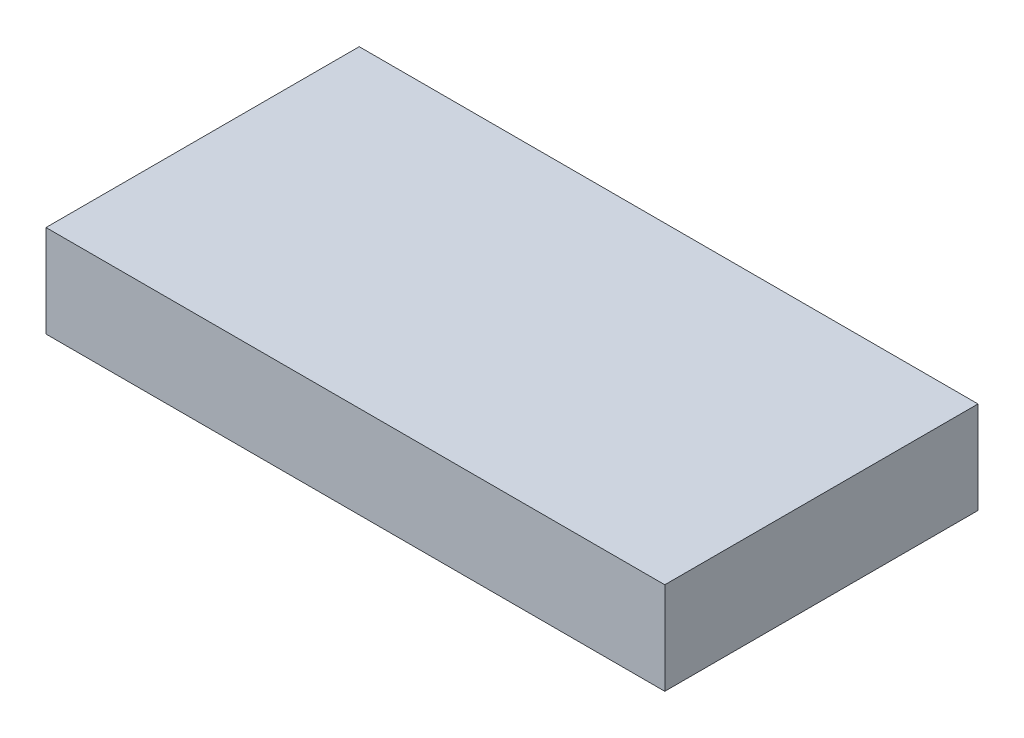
ISO-10303-21;
HEADER;
FILE_DESCRIPTION(('STEP AP214'),'2;1');
FILE_NAME('part.step','',(''),(''),'','','');
FILE_SCHEMA(('AUTOMOTIVE_DESIGN { 1 0 10303 214 1 1 1 1 }'));
ENDSEC;
DATA;
#1=APPLICATION_CONTEXT('core data for automotive mechanical design processes');
#2=APPLICATION_PROTOCOL_DEFINITION('international standard','automotive_design',2000,#1);
#3=PRODUCT_CONTEXT('',#1,'mechanical');
#4=PRODUCT('Part','Part','',(#3));
#5=PRODUCT_RELATED_PRODUCT_CATEGORY('part','',(#4));
#6=PRODUCT_DEFINITION_FORMATION('','',#4);
#7=PRODUCT_DEFINITION_CONTEXT('part definition',#1,'design');
#8=PRODUCT_DEFINITION('design','',#6,#7);
#9=PRODUCT_DEFINITION_SHAPE('','',#8);
#10=(LENGTH_UNIT() NAMED_UNIT(*) SI_UNIT(.MILLI.,.METRE.));
#11=(NAMED_UNIT(*) PLANE_ANGLE_UNIT() SI_UNIT($,.RADIAN.));
#12=(NAMED_UNIT(*) SI_UNIT($,.STERADIAN.) SOLID_ANGLE_UNIT());
#13=UNCERTAINTY_MEASURE_WITH_UNIT(LENGTH_MEASURE(1.E-05),#10,'distance_accuracy_value','');
#14=(GEOMETRIC_REPRESENTATION_CONTEXT(3) GLOBAL_UNCERTAINTY_ASSIGNED_CONTEXT((#13)) GLOBAL_UNIT_ASSIGNED_CONTEXT((#10,
#11,#12)) REPRESENTATION_CONTEXT('',''));
#15=CARTESIAN_POINT('',(0.,0.,0.));
#16=DIRECTION('',(0.,0.,1.));
#17=DIRECTION('',(1.,0.,0.));
#18=AXIS2_PLACEMENT_3D('',#15,#16,#17);
#19=CARTESIAN_POINT('',(0.,0.,0.));
#20=DIRECTION('',(0.,1.,0.));
#21=DIRECTION('',(-1.,0.,0.));
#22=AXIS2_PLACEMENT_3D('',#19,#20,#21);
#23=PLANE('',#22);
#24=CARTESIAN_POINT('',(23.5,-1.64099622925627E-13,-54.016));
#25=DIRECTION('',(0.,1.,0.));
#26=DIRECTION('',(-1.,0.,0.));
#27=AXIS2_PLACEMENT_3D('',#24,#25,#26);
#28=CIRCLE('',#27,2.5);
#29=CARTESIAN_POINT('',(21.,-1.46642216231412E-13,-54.016));
#30=VERTEX_POINT('',#29);
#31=EDGE_CURVE('E403',#30,#30,#28,.T.);
#32=ORIENTED_EDGE('',*,*,#31,.T.);
#33=EDGE_LOOP('',(#32));
#34=FACE_BOUND('',#33,.T.);
#35=CARTESIAN_POINT('',(-23.5,1.64099622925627E-13,-54.016));
#36=DIRECTION('',(0.,1.,0.));
#37=DIRECTION('',(-1.,0.,0.));
#38=AXIS2_PLACEMENT_3D('',#35,#36,#37);
#39=CIRCLE('',#38,2.5);
#40=CARTESIAN_POINT('',(-26.,1.81557029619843E-13,-54.016));
#41=VERTEX_POINT('',#40);
#42=EDGE_CURVE('E11',#41,#41,#39,.F.);
#43=ORIENTED_EDGE('',*,*,#42,.F.);
#44=EDGE_LOOP('',(#43));
#45=FACE_BOUND('',#44,.T.);
#46=CARTESIAN_POINT('',(23.5,-1.64099622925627E-13,-5.166));
#47=DIRECTION('',(0.,1.,0.));
#48=DIRECTION('',(-1.,0.,0.));
#49=AXIS2_PLACEMENT_3D('',#46,#47,#48);
#50=CIRCLE('',#49,2.5);
#51=CARTESIAN_POINT('',(21.,-1.46642216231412E-13,-5.166));
#52=VERTEX_POINT('',#51);
#53=EDGE_CURVE('E257',#52,#52,#50,.T.);
#54=ORIENTED_EDGE('',*,*,#53,.T.);
#55=EDGE_LOOP('',(#54));
#56=FACE_BOUND('',#55,.T.);
#57=CARTESIAN_POINT('',(-23.5,1.64099622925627E-13,-5.166));
#58=DIRECTION('',(0.,1.,0.));
#59=DIRECTION('',(-1.,0.,0.));
#60=AXIS2_PLACEMENT_3D('',#57,#58,#59);
#61=CIRCLE('',#60,2.5);
#62=CARTESIAN_POINT('',(-26.,1.81557029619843E-13,-5.166));
#63=VERTEX_POINT('',#62);
#64=EDGE_CURVE('E42',#63,#63,#61,.F.);
#65=ORIENTED_EDGE('',*,*,#64,.F.);
#66=EDGE_LOOP('',(#65));
#67=FACE_BOUND('',#66,.T.);
#68=DIRECTION('',(0.,0.,-1.));
#69=VECTOR('',#68,1.);
#70=CARTESIAN_POINT('',(2.76195092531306,0.,4.84));
#71=LINE('',#70,#69);
#72=CARTESIAN_POINT('',(2.76195092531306,0.,0.));
#73=VERTEX_POINT('',#72);
#74=CARTESIAN_POINT('',(2.76195092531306,0.,2.334));
#75=VERTEX_POINT('',#74);
#76=EDGE_CURVE('E50',#73,#75,#71,.F.);
#77=ORIENTED_EDGE('',*,*,#76,.F.);
#78=DIRECTION('',(-1.,0.,0.));
#79=VECTOR('',#78,1.);
#80=CARTESIAN_POINT('',(-5.00000000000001,0.,0.));
#81=LINE('',#80,#79);
#82=CARTESIAN_POINT('',(5.00000000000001,0.,0.));
#83=VERTEX_POINT('',#82);
#84=EDGE_CURVE('E355',#83,#73,#81,.T.);
#85=ORIENTED_EDGE('',*,*,#84,.F.);
#86=DIRECTION('',(0.,0.,-1.));
#87=VECTOR('',#86,1.);
#88=CARTESIAN_POINT('',(5.00000000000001,0.,-15.));
#89=LINE('',#88,#87);
#90=CARTESIAN_POINT('',(5.00000000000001,0.,-15.));
#91=VERTEX_POINT('',#90);
#92=EDGE_CURVE('E333',#83,#91,#89,.T.);
#93=ORIENTED_EDGE('',*,*,#92,.T.);
#94=DIRECTION('',(1.,0.,0.));
#95=VECTOR('',#94,1.);
#96=CARTESIAN_POINT('',(10.,0.,-15.));
#97=LINE('',#96,#95);
#98=CARTESIAN_POINT('',(10.,0.,-15.));
#99=VERTEX_POINT('',#98);
#100=EDGE_CURVE('E336',#91,#99,#97,.T.);
#101=ORIENTED_EDGE('',*,*,#100,.T.);
#102=CARTESIAN_POINT('',(5.62175338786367,0.,-17.4147373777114));
#103=DIRECTION('',(0.,1.,0.));
#104=DIRECTION('',(0.,0.,1.));
#105=AXIS2_PLACEMENT_3D('',#102,#103,#104);
#106=CIRCLE('',#105,5.);
#107=CARTESIAN_POINT('',(10.6036052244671,0.,-17.8403572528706));
#108=VERTEX_POINT('',#107);
#109=EDGE_CURVE('E339',#99,#108,#106,.T.);
#110=ORIENTED_EDGE('',*,*,#109,.T.);
#111=CARTESIAN_POINT('',(44.5633042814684,0.,-27.0225804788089));
#112=DIRECTION('',(0.,-1.,0.));
#113=DIRECTION('',(0.,0.,1.));
#114=AXIS2_PLACEMENT_3D('',#111,#112,#113);
#115=CIRCLE('',#114,35.1791754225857);
#116=CARTESIAN_POINT('',(10.6036052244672,0.,-36.2048037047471));
#117=VERTEX_POINT('',#116);
#118=EDGE_CURVE('E342',#108,#117,#115,.T.);
#119=ORIENTED_EDGE('',*,*,#118,.T.);
#120=CARTESIAN_POINT('',(7.31035400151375,0.,-39.9670498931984));
#121=DIRECTION('',(0.,1.,0.));
#122=DIRECTION('',(0.,0.,-1.));
#123=AXIS2_PLACEMENT_3D('',#120,#121,#122);
#124=CIRCLE('',#123,5.);
#125=CARTESIAN_POINT('',(10.,0.,-44.182));
#126=VERTEX_POINT('',#125);
#127=EDGE_CURVE('E345',#117,#126,#124,.T.);
#128=ORIENTED_EDGE('',*,*,#127,.T.);
#129=DIRECTION('',(-1.,0.,0.));
#130=VECTOR('',#129,1.);
#131=CARTESIAN_POINT('',(5.,0.,-44.182));
#132=LINE('',#131,#130);
#133=CARTESIAN_POINT('',(5.,0.,-44.182));
#134=VERTEX_POINT('',#133);
#135=EDGE_CURVE('E348',#126,#134,#132,.T.);
#136=ORIENTED_EDGE('',*,*,#135,.T.);
#137=DIRECTION('',(0.,0.,-1.));
#138=VECTOR('',#137,1.);
#139=CARTESIAN_POINT('',(5.,0.,-59.182));
#140=LINE('',#139,#138);
#141=CARTESIAN_POINT('',(5.,0.,-59.182));
#142=VERTEX_POINT('',#141);
#143=EDGE_CURVE('E351',#134,#142,#140,.T.);
#144=ORIENTED_EDGE('',*,*,#143,.T.);
#145=DIRECTION('',(1.,0.,0.));
#146=VECTOR('',#145,1.);
#147=CARTESIAN_POINT('',(0.,0.,-59.182));
#148=LINE('',#147,#146);
#149=CARTESIAN_POINT('',(-5.,0.,-59.182));
#150=VERTEX_POINT('',#149);
#151=EDGE_CURVE('E378',#150,#142,#148,.T.);
#152=ORIENTED_EDGE('',*,*,#151,.F.);
#153=DIRECTION('',(0.,0.,-1.));
#154=VECTOR('',#153,1.);
#155=CARTESIAN_POINT('',(-5.,0.,-59.182));
#156=LINE('',#155,#154);
#157=CARTESIAN_POINT('',(-5.,0.,-44.182));
#158=VERTEX_POINT('',#157);
#159=EDGE_CURVE('E375',#158,#150,#156,.T.);
#160=ORIENTED_EDGE('',*,*,#159,.F.);
#161=DIRECTION('',(1.,0.,0.));
#162=VECTOR('',#161,1.);
#163=CARTESIAN_POINT('',(-5.,0.,-44.182));
#164=LINE('',#163,#162);
#165=CARTESIAN_POINT('',(-10.,0.,-44.182));
#166=VERTEX_POINT('',#165);
#167=EDGE_CURVE('E372',#166,#158,#164,.T.);
#168=ORIENTED_EDGE('',*,*,#167,.F.);
#169=CARTESIAN_POINT('',(-7.31035400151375,0.,-39.9670498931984));
#170=DIRECTION('',(0.,-1.,0.));
#171=DIRECTION('',(0.,0.,-1.));
#172=AXIS2_PLACEMENT_3D('',#169,#170,#171);
#173=CIRCLE('',#172,5.);
#174=CARTESIAN_POINT('',(-10.6036052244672,0.,-36.2048037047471));
#175=VERTEX_POINT('',#174);
#176=EDGE_CURVE('E369',#175,#166,#173,.T.);
#177=ORIENTED_EDGE('',*,*,#176,.F.);
#178=CARTESIAN_POINT('',(-44.5633042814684,3.11183890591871E-13,-27.0225804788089));
#179=DIRECTION('',(0.,1.,0.));
#180=DIRECTION('',(0.,0.,1.));
#181=AXIS2_PLACEMENT_3D('',#178,#179,#180);
#182=CIRCLE('',#181,35.1791754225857);
#183=CARTESIAN_POINT('',(-10.6036052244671,0.,-17.8403572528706));
#184=VERTEX_POINT('',#183);
#185=EDGE_CURVE('E366',#184,#175,#182,.T.);
#186=ORIENTED_EDGE('',*,*,#185,.F.);
#187=CARTESIAN_POINT('',(-5.62175338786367,0.,-17.4147373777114));
#188=DIRECTION('',(0.,-1.,0.));
#189=DIRECTION('',(0.,0.,1.));
#190=AXIS2_PLACEMENT_3D('',#187,#188,#189);
#191=CIRCLE('',#190,5.);
#192=CARTESIAN_POINT('',(-10.,0.,-15.));
#193=VERTEX_POINT('',#192);
#194=EDGE_CURVE('E363',#193,#184,#191,.T.);
#195=ORIENTED_EDGE('',*,*,#194,.F.);
#196=DIRECTION('',(-1.,0.,0.));
#197=VECTOR('',#196,1.);
#198=CARTESIAN_POINT('',(-10.,0.,-15.));
#199=LINE('',#198,#197);
#200=CARTESIAN_POINT('',(-5.00000000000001,0.,-15.));
#201=VERTEX_POINT('',#200);
#202=EDGE_CURVE('E360',#201,#193,#199,.T.);
#203=ORIENTED_EDGE('',*,*,#202,.F.);
#204=DIRECTION('',(0.,0.,-1.));
#205=VECTOR('',#204,1.);
#206=CARTESIAN_POINT('',(-5.00000000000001,0.,-15.));
#207=LINE('',#206,#205);
#208=CARTESIAN_POINT('',(-5.00000000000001,0.,0.));
#209=VERTEX_POINT('',#208);
#210=EDGE_CURVE('E357',#209,#201,#207,.T.);
#211=ORIENTED_EDGE('',*,*,#210,.F.);
#212=CARTESIAN_POINT('',(-2.76195092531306,0.,0.));
#213=VERTEX_POINT('',#212);
#214=EDGE_CURVE('E354',#213,#209,#81,.T.);
#215=ORIENTED_EDGE('',*,*,#214,.F.);
#216=DIRECTION('',(0.,0.,-1.));
#217=VECTOR('',#216,1.);
#218=CARTESIAN_POINT('',(-2.76195092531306,0.,4.84));
#219=LINE('',#218,#217);
#220=CARTESIAN_POINT('',(-2.76195092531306,0.,2.334));
#221=VERTEX_POINT('',#220);
#222=EDGE_CURVE('E57',#221,#213,#219,.T.);
#223=ORIENTED_EDGE('',*,*,#222,.F.);
#224=DIRECTION('',(-1.,0.,0.));
#225=VECTOR('',#224,1.);
#226=CARTESIAN_POINT('',(-31.5,2.19963324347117E-13,2.334));
#227=LINE('',#226,#225);
#228=CARTESIAN_POINT('',(-31.5,2.19963324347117E-13,2.334));
#229=VERTEX_POINT('',#228);
#230=EDGE_CURVE('E285',#221,#229,#227,.T.);
#231=ORIENTED_EDGE('',*,*,#230,.T.);
#232=DIRECTION('',(0.,0.,-1.));
#233=VECTOR('',#232,1.);
#234=CARTESIAN_POINT('',(-31.5,2.19963324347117E-13,2.334));
#235=LINE('',#234,#233);
#236=CARTESIAN_POINT('',(-31.5,2.19963324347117E-13,-61.516));
#237=VERTEX_POINT('',#236);
#238=EDGE_CURVE('E299',#229,#237,#235,.T.);
#239=ORIENTED_EDGE('',*,*,#238,.T.);
#240=DIRECTION('',(1.,0.,0.));
#241=VECTOR('',#240,1.);
#242=CARTESIAN_POINT('',(-31.5,2.19963324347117E-13,-61.516));
#243=LINE('',#242,#241);
#244=CARTESIAN_POINT('',(31.5,-2.19963324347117E-13,-61.516));
#245=VERTEX_POINT('',#244);
#246=EDGE_CURVE('E302',#237,#245,#243,.T.);
#247=ORIENTED_EDGE('',*,*,#246,.T.);
#248=DIRECTION('',(0.,0.,1.));
#249=VECTOR('',#248,1.);
#250=CARTESIAN_POINT('',(31.5,-2.19963324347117E-13,2.334));
#251=LINE('',#250,#249);
#252=CARTESIAN_POINT('',(31.5,-2.19963324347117E-13,2.334));
#253=VERTEX_POINT('',#252);
#254=EDGE_CURVE('E289',#245,#253,#251,.T.);
#255=ORIENTED_EDGE('',*,*,#254,.T.);
#256=EDGE_CURVE('E297',#253,#75,#227,.T.);
#257=ORIENTED_EDGE('',*,*,#256,.T.);
#258=EDGE_LOOP('',(#77,#85,#93,#101,#110,#119,#128,#136,#144,#152,#160,#168,#177,#186,#195,#203,
#211,#215,#223,#231,#239,#247,#255,#257));
#259=FACE_BOUND('',#258,.T.);
#260=ADVANCED_FACE('F33',(#34,#45,#56,#67,#259),#23,.F.);
#261=CARTESIAN_POINT('',(-34.5,3.00000000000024,-64.516));
#262=DIRECTION('',(0.,0.,1.));
#263=DIRECTION('',(1.,0.,0.));
#264=AXIS2_PLACEMENT_3D('',#261,#262,#263);
#265=PLANE('',#264);
#266=DIRECTION('',(-1.,0.,0.));
#267=VECTOR('',#266,1.);
#268=CARTESIAN_POINT('',(-34.5,3.00000000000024,-64.516));
#269=LINE('',#268,#267);
#270=CARTESIAN_POINT('',(103.5,2.99999999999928,-64.516));
#271=VERTEX_POINT('',#270);
#272=CARTESIAN_POINT('',(-34.5,3.00000000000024,-64.516));
#273=VERTEX_POINT('',#272);
#274=EDGE_CURVE('E323',#271,#273,#269,.T.);
#275=ORIENTED_EDGE('',*,*,#274,.F.);
#276=DIRECTION('',(0.,-1.,0.));
#277=VECTOR('',#276,1.);
#278=CARTESIAN_POINT('',(103.5,2.99999999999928,-64.516));
#279=LINE('',#278,#277);
#280=CARTESIAN_POINT('',(103.5,-17.5800000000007,-64.516));
#281=VERTEX_POINT('',#280);
#282=EDGE_CURVE('E578',#271,#281,#279,.T.);
#283=ORIENTED_EDGE('',*,*,#282,.T.);
#284=DIRECTION('',(1.,0.,0.));
#285=VECTOR('',#284,1.);
#286=CARTESIAN_POINT('',(-34.5000000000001,-17.5799999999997,-64.516));
#287=LINE('',#286,#285);
#288=CARTESIAN_POINT('',(-34.5000000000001,-17.5799999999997,-64.516));
#289=VERTEX_POINT('',#288);
#290=EDGE_CURVE('E318',#289,#281,#287,.T.);
#291=ORIENTED_EDGE('',*,*,#290,.F.);
#292=DIRECTION('',(0.,-1.,0.));
#293=VECTOR('',#292,1.);
#294=CARTESIAN_POINT('',(-34.5,3.00000000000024,-64.516));
#295=LINE('',#294,#293);
#296=EDGE_CURVE('E331',#273,#289,#295,.T.);
#297=ORIENTED_EDGE('',*,*,#296,.F.);
#298=EDGE_LOOP('',(#275,#283,#291,#297));
#299=FACE_BOUND('',#298,.T.);
#300=ADVANCED_FACE('F431',(#299),#265,.F.);
#301=CARTESIAN_POINT('',(-34.5,3.00000000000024,-64.516));
#302=DIRECTION('',(1.,0.,0.));
#303=DIRECTION('',(0.,1.,0.));
#304=AXIS2_PLACEMENT_3D('',#301,#302,#303);
#305=PLANE('',#304);
#306=ORIENTED_EDGE('',*,*,#296,.T.);
#307=DIRECTION('',(0.,0.,-1.));
#308=VECTOR('',#307,1.);
#309=CARTESIAN_POINT('',(-34.5000000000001,-17.5799999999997,5.334));
#310=LINE('',#309,#308);
#311=CARTESIAN_POINT('',(-34.5000000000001,-17.5799999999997,5.334));
#312=VERTEX_POINT('',#311);
#313=EDGE_CURVE('E315',#312,#289,#310,.T.);
#314=ORIENTED_EDGE('',*,*,#313,.F.);
#315=DIRECTION('',(0.,-1.,0.));
#316=VECTOR('',#315,1.);
#317=CARTESIAN_POINT('',(-34.5,3.00000000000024,5.334));
#318=LINE('',#317,#316);
#319=CARTESIAN_POINT('',(-34.5,3.00000000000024,5.334));
#320=VERTEX_POINT('',#319);
#321=EDGE_CURVE('E329',#320,#312,#318,.T.);
#322=ORIENTED_EDGE('',*,*,#321,.F.);
#323=DIRECTION('',(0.,0.,1.));
#324=VECTOR('',#323,1.);
#325=CARTESIAN_POINT('',(-34.5,3.00000000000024,-64.516));
#326=LINE('',#325,#324);
#327=EDGE_CURVE('E325',#273,#320,#326,.T.);
#328=ORIENTED_EDGE('',*,*,#327,.F.);
#329=EDGE_LOOP('',(#306,#314,#322,#328));
#330=FACE_BOUND('',#329,.T.);
#331=ADVANCED_FACE('F437',(#330),#305,.F.);
#332=CARTESIAN_POINT('',(-34.5,3.00000000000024,5.334));
#333=DIRECTION('',(0.,0.,-1.));
#334=DIRECTION('',(-1.,0.,0.));
#335=AXIS2_PLACEMENT_3D('',#332,#333,#334);
#336=PLANE('',#335);
#337=ORIENTED_EDGE('',*,*,#321,.T.);
#338=DIRECTION('',(-1.,0.,0.));
#339=VECTOR('',#338,1.);
#340=CARTESIAN_POINT('',(-34.5000000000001,-17.5799999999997,5.334));
#341=LINE('',#340,#339);
#342=CARTESIAN_POINT('',(103.5,-17.5800000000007,5.33399999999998));
#343=VERTEX_POINT('',#342);
#344=EDGE_CURVE('E320',#343,#312,#341,.T.);
#345=ORIENTED_EDGE('',*,*,#344,.F.);
#346=DIRECTION('',(0.,-1.,0.));
#347=VECTOR('',#346,1.);
#348=CARTESIAN_POINT('',(103.5,2.99999999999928,5.33399999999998));
#349=LINE('',#348,#347);
#350=CARTESIAN_POINT('',(103.5,2.99999999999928,5.33399999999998));
#351=VERTEX_POINT('',#350);
#352=EDGE_CURVE('E575',#351,#343,#349,.T.);
#353=ORIENTED_EDGE('',*,*,#352,.F.);
#354=DIRECTION('',(1.,0.,0.));
#355=VECTOR('',#354,1.);
#356=CARTESIAN_POINT('',(-34.5,3.00000000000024,5.334));
#357=LINE('',#356,#355);
#358=EDGE_CURVE('E327',#320,#351,#357,.T.);
#359=ORIENTED_EDGE('',*,*,#358,.F.);
#360=EDGE_LOOP('',(#337,#345,#353,#359));
#361=FACE_BOUND('',#360,.T.);
#362=ADVANCED_FACE('F445',(#361),#336,.F.);
#363=CARTESIAN_POINT('',(0.,3.,0.));
#364=DIRECTION('',(0.,1.,0.));
#365=DIRECTION('',(-1.,0.,0.));
#366=AXIS2_PLACEMENT_3D('',#363,#364,#365);
#367=PLANE('',#366);
#368=ORIENTED_EDGE('',*,*,#358,.T.);
#369=DIRECTION('',(0.,0.,1.));
#370=VECTOR('',#369,1.);
#371=CARTESIAN_POINT('',(103.5,2.99999999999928,-64.516));
#372=LINE('',#371,#370);
#373=EDGE_CURVE('E572',#271,#351,#372,.T.);
#374=ORIENTED_EDGE('',*,*,#373,.F.);
#375=ORIENTED_EDGE('',*,*,#274,.T.);
#376=ORIENTED_EDGE('',*,*,#327,.T.);
#377=EDGE_LOOP('',(#368,#374,#375,#376));
#378=FACE_BOUND('',#377,.T.);
#379=ADVANCED_FACE('F443',(#378),#367,.T.);
#380=CARTESIAN_POINT('',(-1.22760483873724E-13,-17.5799999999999,0.));
#381=DIRECTION('',(0.,-1.,0.));
#382=DIRECTION('',(1.,0.,0.));
#383=AXIS2_PLACEMENT_3D('',#380,#381,#382);
#384=PLANE('',#383);
#385=ORIENTED_EDGE('',*,*,#313,.T.);
#386=ORIENTED_EDGE('',*,*,#290,.T.);
#387=DIRECTION('',(0.,0.,-1.));
#388=VECTOR('',#387,1.);
#389=CARTESIAN_POINT('',(103.5,-17.5800000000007,5.33399999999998));
#390=LINE('',#389,#388);
#391=EDGE_CURVE('E569',#343,#281,#390,.T.);
#392=ORIENTED_EDGE('',*,*,#391,.F.);
#393=ORIENTED_EDGE('',*,*,#344,.T.);
#394=EDGE_LOOP('',(#385,#386,#392,#393));
#395=FACE_BOUND('',#394,.T.);
#396=DIRECTION('',(0.,0.,-1.));
#397=VECTOR('',#396,1.);
#398=CARTESIAN_POINT('',(-31.5000000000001,-17.5799999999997,2.334));
#399=LINE('',#398,#397);
#400=CARTESIAN_POINT('',(-31.5000000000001,-17.5799999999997,2.334));
#401=VERTEX_POINT('',#400);
#402=CARTESIAN_POINT('',(-31.5000000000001,-17.5799999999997,-61.516));
#403=VERTEX_POINT('',#402);
#404=EDGE_CURVE('E288',#401,#403,#399,.T.);
#405=ORIENTED_EDGE('',*,*,#404,.F.);
#406=DIRECTION('',(-1.,0.,0.));
#407=VECTOR('',#406,1.);
#408=CARTESIAN_POINT('',(-31.5000000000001,-17.5799999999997,2.334));
#409=LINE('',#408,#407);
#410=CARTESIAN_POINT('',(31.4999999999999,-17.5800000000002,2.334));
#411=VERTEX_POINT('',#410);
#412=EDGE_CURVE('E286',#411,#401,#409,.T.);
#413=ORIENTED_EDGE('',*,*,#412,.F.);
#414=DIRECTION('',(0.,0.,1.));
#415=VECTOR('',#414,1.);
#416=CARTESIAN_POINT('',(31.4999999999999,-17.5800000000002,2.334));
#417=LINE('',#416,#415);
#418=CARTESIAN_POINT('',(31.4999999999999,-17.5800000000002,-61.516));
#419=VERTEX_POINT('',#418);
#420=EDGE_CURVE('E294',#419,#411,#417,.T.);
#421=ORIENTED_EDGE('',*,*,#420,.F.);
#422=DIRECTION('',(1.,0.,0.));
#423=VECTOR('',#422,1.);
#424=CARTESIAN_POINT('',(-31.5000000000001,-17.5799999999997,-61.516));
#425=LINE('',#424,#423);
#426=EDGE_CURVE('E291',#403,#419,#425,.T.);
#427=ORIENTED_EDGE('',*,*,#426,.F.);
#428=EDGE_LOOP('',(#405,#413,#421,#427));
#429=FACE_BOUND('',#428,.T.);
#430=DIRECTION('',(0.,0.,-1.));
#431=VECTOR('',#430,1.);
#432=CARTESIAN_POINT('',(100.5,-17.5800000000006,2.33399999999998));
#433=LINE('',#432,#431);
#434=CARTESIAN_POINT('',(100.5,-17.5800000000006,2.33399999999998));
#435=VERTEX_POINT('',#434);
#436=CARTESIAN_POINT('',(100.5,-17.5800000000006,-61.516));
#437=VERTEX_POINT('',#436);
#438=EDGE_CURVE('E535',#435,#437,#433,.T.);
#439=ORIENTED_EDGE('',*,*,#438,.T.);
#440=DIRECTION('',(-1.,0.,0.));
#441=VECTOR('',#440,1.);
#442=CARTESIAN_POINT('',(100.5,-17.5800000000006,-61.516));
#443=LINE('',#442,#441);
#444=CARTESIAN_POINT('',(37.4999999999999,-17.5800000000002,-61.516));
#445=VERTEX_POINT('',#444);
#446=EDGE_CURVE('E538',#437,#445,#443,.T.);
#447=ORIENTED_EDGE('',*,*,#446,.T.);
#448=DIRECTION('',(0.,0.,1.));
#449=VECTOR('',#448,1.);
#450=CARTESIAN_POINT('',(37.4999999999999,-17.5800000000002,2.334));
#451=LINE('',#450,#449);
#452=CARTESIAN_POINT('',(37.4999999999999,-17.5800000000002,2.334));
#453=VERTEX_POINT('',#452);
#454=EDGE_CURVE('E543',#445,#453,#451,.T.);
#455=ORIENTED_EDGE('',*,*,#454,.T.);
#456=DIRECTION('',(1.,0.,0.));
#457=VECTOR('',#456,1.);
#458=CARTESIAN_POINT('',(100.5,-17.5800000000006,2.33399999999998));
#459=LINE('',#458,#457);
#460=EDGE_CURVE('E540',#453,#435,#459,.T.);
#461=ORIENTED_EDGE('',*,*,#460,.T.);
#462=EDGE_LOOP('',(#439,#447,#455,#461));
#463=FACE_BOUND('',#462,.T.);
#464=ADVANCED_FACE('F517',(#395,#429,#463),#384,.T.);
#465=CARTESIAN_POINT('',(-31.5000000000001,-17.5799999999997,2.334));
#466=DIRECTION('',(0.,0.,-1.));
#467=DIRECTION('',(-1.,0.,0.));
#468=AXIS2_PLACEMENT_3D('',#465,#466,#467);
#469=PLANE('',#468);
#470=ORIENTED_EDGE('',*,*,#230,.F.);
#471=CARTESIAN_POINT('',(0.,0.,2.334));
#472=DIRECTION('',(0.,0.,-1.));
#473=DIRECTION('',(-1.,0.,0.));
#474=AXIS2_PLACEMENT_3D('',#471,#472,#473);
#475=CIRCLE('',#474,2.76195092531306);
#476=EDGE_CURVE('E283',#221,#75,#475,.F.);
#477=ORIENTED_EDGE('',*,*,#476,.T.);
#478=ORIENTED_EDGE('',*,*,#256,.F.);
#479=DIRECTION('',(0.,1.,0.));
#480=VECTOR('',#479,1.);
#481=CARTESIAN_POINT('',(31.4999999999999,-17.5800000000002,2.334));
#482=LINE('',#481,#480);
#483=EDGE_CURVE('E296',#411,#253,#482,.T.);
#484=ORIENTED_EDGE('',*,*,#483,.F.);
#485=ORIENTED_EDGE('',*,*,#412,.T.);
#486=DIRECTION('',(0.,1.,0.));
#487=VECTOR('',#486,1.);
#488=CARTESIAN_POINT('',(-31.5000000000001,-17.5799999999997,2.334));
#489=LINE('',#488,#487);
#490=EDGE_CURVE('E312',#401,#229,#489,.T.);
#491=ORIENTED_EDGE('',*,*,#490,.T.);
#492=EDGE_LOOP('',(#470,#477,#478,#484,#485,#491));
#493=FACE_BOUND('',#492,.T.);
#494=ADVANCED_FACE('F514',(#493),#469,.T.);
#495=CARTESIAN_POINT('',(-31.5000000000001,-17.5799999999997,2.334));
#496=DIRECTION('',(1.,0.,0.));
#497=DIRECTION('',(0.,1.,0.));
#498=AXIS2_PLACEMENT_3D('',#495,#496,#497);
#499=PLANE('',#498);
#500=ORIENTED_EDGE('',*,*,#238,.F.);
#501=ORIENTED_EDGE('',*,*,#490,.F.);
#502=ORIENTED_EDGE('',*,*,#404,.T.);
#503=DIRECTION('',(0.,1.,0.));
#504=VECTOR('',#503,1.);
#505=CARTESIAN_POINT('',(-31.5000000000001,-17.5799999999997,-61.516));
#506=LINE('',#505,#504);
#507=EDGE_CURVE('E310',#403,#237,#506,.T.);
#508=ORIENTED_EDGE('',*,*,#507,.T.);
#509=EDGE_LOOP('',(#500,#501,#502,#508));
#510=FACE_BOUND('',#509,.T.);
#511=ADVANCED_FACE('F506',(#510),#499,.T.);
#512=CARTESIAN_POINT('',(-31.5000000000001,-17.5799999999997,-61.516));
#513=DIRECTION('',(0.,0.,1.));
#514=DIRECTION('',(1.,0.,0.));
#515=AXIS2_PLACEMENT_3D('',#512,#513,#514);
#516=PLANE('',#515);
#517=ORIENTED_EDGE('',*,*,#246,.F.);
#518=ORIENTED_EDGE('',*,*,#507,.F.);
#519=ORIENTED_EDGE('',*,*,#426,.T.);
#520=DIRECTION('',(0.,1.,0.));
#521=VECTOR('',#520,1.);
#522=CARTESIAN_POINT('',(31.4999999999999,-17.5800000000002,-61.516));
#523=LINE('',#522,#521);
#524=EDGE_CURVE('E308',#419,#245,#523,.T.);
#525=ORIENTED_EDGE('',*,*,#524,.T.);
#526=EDGE_LOOP('',(#517,#518,#519,#525));
#527=FACE_BOUND('',#526,.T.);
#528=ADVANCED_FACE('F500',(#527),#516,.T.);
#529=CARTESIAN_POINT('',(31.4999999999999,-17.5800000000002,2.334));
#530=DIRECTION('',(-1.,0.,0.));
#531=DIRECTION('',(0.,-1.,0.));
#532=AXIS2_PLACEMENT_3D('',#529,#530,#531);
#533=PLANE('',#532);
#534=ORIENTED_EDGE('',*,*,#254,.F.);
#535=ORIENTED_EDGE('',*,*,#524,.F.);
#536=ORIENTED_EDGE('',*,*,#420,.T.);
#537=ORIENTED_EDGE('',*,*,#483,.T.);
#538=EDGE_LOOP('',(#534,#535,#536,#537));
#539=FACE_BOUND('',#538,.T.);
#540=ADVANCED_FACE('F496',(#539),#533,.T.);
#541=CARTESIAN_POINT('',(0.,0.,-59.182));
#542=DIRECTION('',(0.,0.,-1.));
#543=DIRECTION('',(-1.,0.,0.));
#544=AXIS2_PLACEMENT_3D('',#541,#542,#543);
#545=PLANE('',#544);
#546=CARTESIAN_POINT('',(0.,0.,-59.182));
#547=DIRECTION('',(0.,0.,1.));
#548=DIRECTION('',(1.,0.,0.));
#549=AXIS2_PLACEMENT_3D('',#546,#547,#548);
#550=CIRCLE('',#549,5.);
#551=EDGE_CURVE('E395',#150,#142,#550,.T.);
#552=ORIENTED_EDGE('',*,*,#551,.F.);
#553=ORIENTED_EDGE('',*,*,#151,.T.);
#554=EDGE_LOOP('',(#552,#553));
#555=FACE_BOUND('',#554,.T.);
#556=ADVANCED_FACE('F35',(#555),#545,.T.);
#557=CARTESIAN_POINT('',(-5.00000000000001,0.,0.));
#558=DIRECTION('',(0.,0.,1.));
#559=DIRECTION('',(1.,0.,0.));
#560=AXIS2_PLACEMENT_3D('',#557,#558,#559);
#561=PLANE('',#560);
#562=ORIENTED_EDGE('',*,*,#84,.T.);
#563=CARTESIAN_POINT('',(0.,0.,0.));
#564=DIRECTION('',(0.,0.,1.));
#565=DIRECTION('',(1.,0.,0.));
#566=AXIS2_PLACEMENT_3D('',#563,#564,#565);
#567=CIRCLE('',#566,2.76195092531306);
#568=EDGE_CURVE('E275',#213,#73,#567,.T.);
#569=ORIENTED_EDGE('',*,*,#568,.F.);
#570=ORIENTED_EDGE('',*,*,#214,.T.);
#571=CARTESIAN_POINT('',(0.,0.,0.));
#572=DIRECTION('',(0.,0.,1.));
#573=DIRECTION('',(1.,0.,0.));
#574=AXIS2_PLACEMENT_3D('',#571,#572,#573);
#575=CIRCLE('',#574,5.00000000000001);
#576=EDGE_CURVE('E380',#209,#83,#575,.T.);
#577=ORIENTED_EDGE('',*,*,#576,.T.);
#578=EDGE_LOOP('',(#562,#569,#570,#577));
#579=FACE_BOUND('',#578,.T.);
#580=ADVANCED_FACE('F452',(#579),#561,.T.);
#581=CARTESIAN_POINT('',(0.,0.,0.));
#582=DIRECTION('',(0.,0.,1.));
#583=DIRECTION('',(1.,0.,0.));
#584=AXIS2_PLACEMENT_3D('',#581,#582,#583);
#585=CYLINDRICAL_SURFACE('',#584,5.00000000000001);
#586=ORIENTED_EDGE('',*,*,#210,.T.);
#587=CARTESIAN_POINT('',(0.,0.,-15.));
#588=DIRECTION('',(0.,0.,1.));
#589=DIRECTION('',(1.,0.,0.));
#590=AXIS2_PLACEMENT_3D('',#587,#588,#589);
#591=CIRCLE('',#590,5.00000000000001);
#592=EDGE_CURVE('E382',#201,#91,#591,.T.);
#593=ORIENTED_EDGE('',*,*,#592,.T.);
#594=ORIENTED_EDGE('',*,*,#92,.F.);
#595=ORIENTED_EDGE('',*,*,#576,.F.);
#596=EDGE_LOOP('',(#586,#593,#594,#595));
#597=FACE_BOUND('',#596,.T.);
#598=ADVANCED_FACE('F455',(#597),#585,.T.);
#599=CARTESIAN_POINT('',(-10.,0.,-15.));
#600=DIRECTION('',(0.,0.,1.));
#601=DIRECTION('',(1.,0.,0.));
#602=AXIS2_PLACEMENT_3D('',#599,#600,#601);
#603=PLANE('',#602);
#604=ORIENTED_EDGE('',*,*,#592,.F.);
#605=ORIENTED_EDGE('',*,*,#202,.T.);
#606=CARTESIAN_POINT('',(0.,0.,-15.));
#607=DIRECTION('',(0.,0.,1.));
#608=DIRECTION('',(1.,0.,0.));
#609=AXIS2_PLACEMENT_3D('',#606,#607,#608);
#610=CIRCLE('',#609,10.);
#611=EDGE_CURVE('E385',#193,#99,#610,.T.);
#612=ORIENTED_EDGE('',*,*,#611,.T.);
#613=ORIENTED_EDGE('',*,*,#100,.F.);
#614=EDGE_LOOP('',(#604,#605,#612,#613));
#615=FACE_BOUND('',#614,.T.);
#616=ADVANCED_FACE('F459',(#615),#603,.T.);
#617=CARTESIAN_POINT('',(0.,0.,-17.4147373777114));
#618=DIRECTION('',(0.,0.,1.));
#619=DIRECTION('',(1.,0.,0.));
#620=AXIS2_PLACEMENT_3D('',#617,#618,#619);
#621=TOROIDAL_SURFACE('',#620,5.62175338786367,5.);
#622=ORIENTED_EDGE('',*,*,#611,.F.);
#623=ORIENTED_EDGE('',*,*,#194,.T.);
#624=CARTESIAN_POINT('',(0.,0.,-17.8403572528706));
#625=DIRECTION('',(0.,0.,1.));
#626=DIRECTION('',(1.,0.,0.));
#627=AXIS2_PLACEMENT_3D('',#624,#625,#626);
#628=CIRCLE('',#627,10.6036052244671);
#629=EDGE_CURVE('E387',#184,#108,#628,.T.);
#630=ORIENTED_EDGE('',*,*,#629,.T.);
#631=ORIENTED_EDGE('',*,*,#109,.F.);
#632=EDGE_LOOP('',(#622,#623,#630,#631));
#633=FACE_BOUND('',#632,.T.);
#634=ADVANCED_FACE('F463',(#633),#621,.T.);
#635=CARTESIAN_POINT('',(0.,0.,-27.0225804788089));
#636=DIRECTION('',(0.,0.,1.));
#637=DIRECTION('',(1.,0.,0.));
#638=AXIS2_PLACEMENT_3D('',#635,#636,#637);
#639=TOROIDAL_SURFACE('',#638,44.5633042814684,35.1791754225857);
#640=ORIENTED_EDGE('',*,*,#629,.F.);
#641=ORIENTED_EDGE('',*,*,#185,.T.);
#642=CARTESIAN_POINT('',(0.,0.,-36.2048037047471));
#643=DIRECTION('',(0.,0.,1.));
#644=DIRECTION('',(1.,0.,0.));
#645=AXIS2_PLACEMENT_3D('',#642,#643,#644);
#646=CIRCLE('',#645,10.6036052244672);
#647=EDGE_CURVE('E389',#175,#117,#646,.T.);
#648=ORIENTED_EDGE('',*,*,#647,.T.);
#649=ORIENTED_EDGE('',*,*,#118,.F.);
#650=EDGE_LOOP('',(#640,#641,#648,#649));
#651=FACE_BOUND('',#650,.T.);
#652=ADVANCED_FACE('F467',(#651),#639,.F.);
#653=CARTESIAN_POINT('',(0.,0.,-39.9670498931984));
#654=DIRECTION('',(0.,0.,1.));
#655=DIRECTION('',(1.,0.,0.));
#656=AXIS2_PLACEMENT_3D('',#653,#654,#655);
#657=TOROIDAL_SURFACE('',#656,7.31035400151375,5.);
#658=ORIENTED_EDGE('',*,*,#647,.F.);
#659=ORIENTED_EDGE('',*,*,#176,.T.);
#660=CARTESIAN_POINT('',(0.,0.,-44.182));
#661=DIRECTION('',(0.,0.,1.));
#662=DIRECTION('',(1.,0.,0.));
#663=AXIS2_PLACEMENT_3D('',#660,#661,#662);
#664=CIRCLE('',#663,10.);
#665=EDGE_CURVE('E391',#166,#126,#664,.T.);
#666=ORIENTED_EDGE('',*,*,#665,.T.);
#667=ORIENTED_EDGE('',*,*,#127,.F.);
#668=EDGE_LOOP('',(#658,#659,#666,#667));
#669=FACE_BOUND('',#668,.T.);
#670=ADVANCED_FACE('F471',(#669),#657,.T.);
#671=CARTESIAN_POINT('',(-5.,0.,-44.182));
#672=DIRECTION('',(0.,0.,-1.));
#673=DIRECTION('',(-1.,0.,0.));
#674=AXIS2_PLACEMENT_3D('',#671,#672,#673);
#675=PLANE('',#674);
#676=ORIENTED_EDGE('',*,*,#665,.F.);
#677=ORIENTED_EDGE('',*,*,#167,.T.);
#678=CARTESIAN_POINT('',(0.,0.,-44.182));
#679=DIRECTION('',(0.,0.,1.));
#680=DIRECTION('',(1.,0.,0.));
#681=AXIS2_PLACEMENT_3D('',#678,#679,#680);
#682=CIRCLE('',#681,5.);
#683=EDGE_CURVE('E393',#158,#134,#682,.T.);
#684=ORIENTED_EDGE('',*,*,#683,.T.);
#685=ORIENTED_EDGE('',*,*,#135,.F.);
#686=EDGE_LOOP('',(#676,#677,#684,#685));
#687=FACE_BOUND('',#686,.T.);
#688=ADVANCED_FACE('F475',(#687),#675,.T.);
#689=CARTESIAN_POINT('',(0.,0.,0.));
#690=DIRECTION('',(0.,0.,1.));
#691=DIRECTION('',(1.,0.,0.));
#692=AXIS2_PLACEMENT_3D('',#689,#690,#691);
#693=CYLINDRICAL_SURFACE('',#692,5.);
#694=ORIENTED_EDGE('',*,*,#683,.F.);
#695=ORIENTED_EDGE('',*,*,#159,.T.);
#696=ORIENTED_EDGE('',*,*,#551,.T.);
#697=ORIENTED_EDGE('',*,*,#143,.F.);
#698=EDGE_LOOP('',(#694,#695,#696,#697));
#699=FACE_BOUND('',#698,.T.);
#700=ADVANCED_FACE('F478',(#699),#693,.T.);
#701=CARTESIAN_POINT('',(0.,0.,4.84));
#702=DIRECTION('',(0.,0.,-1.));
#703=DIRECTION('',(-1.,0.,0.));
#704=AXIS2_PLACEMENT_3D('',#701,#702,#703);
#705=CYLINDRICAL_SURFACE('',#704,2.76195092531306);
#706=ORIENTED_EDGE('',*,*,#568,.T.);
#707=ORIENTED_EDGE('',*,*,#76,.T.);
#708=ORIENTED_EDGE('',*,*,#476,.F.);
#709=ORIENTED_EDGE('',*,*,#222,.T.);
#710=EDGE_LOOP('',(#706,#707,#708,#709));
#711=FACE_BOUND('',#710,.T.);
#712=ADVANCED_FACE('F481',(#711),#705,.T.);
#713=CARTESIAN_POINT('',(69.,-4.81824424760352E-13,0.));
#714=DIRECTION('',(0.,1.,0.));
#715=DIRECTION('',(1.,0.,0.));
#716=AXIS2_PLACEMENT_3D('',#713,#714,#715);
#717=PLANE('',#716);
#718=CARTESIAN_POINT('',(92.5,-6.4592404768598E-13,-54.016));
#719=DIRECTION('',(0.,1.,0.));
#720=DIRECTION('',(-1.,0.,0.));
#721=AXIS2_PLACEMENT_3D('',#718,#719,#720);
#722=CIRCLE('',#721,2.5);
#723=CARTESIAN_POINT('',(90.,-6.28466640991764E-13,-54.016));
#724=VERTEX_POINT('',#723);
#725=EDGE_CURVE('E37',#724,#724,#722,.T.);
#726=ORIENTED_EDGE('',*,*,#725,.T.);
#727=EDGE_LOOP('',(#726));
#728=FACE_BOUND('',#727,.T.);
#729=CARTESIAN_POINT('',(45.5,-3.17724801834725E-13,-54.016));
#730=DIRECTION('',(0.,1.,0.));
#731=DIRECTION('',(-1.,0.,0.));
#732=AXIS2_PLACEMENT_3D('',#729,#730,#731);
#733=CIRCLE('',#732,2.50000000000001);
#734=CARTESIAN_POINT('',(43.,-3.00267395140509E-13,-54.016));
#735=VERTEX_POINT('',#734);
#736=EDGE_CURVE('E412',#735,#735,#733,.T.);
#737=ORIENTED_EDGE('',*,*,#736,.T.);
#738=EDGE_LOOP('',(#737));
#739=FACE_BOUND('',#738,.T.);
#740=CARTESIAN_POINT('',(92.5,-6.45924047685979E-13,-5.166));
#741=DIRECTION('',(0.,1.,0.));
#742=DIRECTION('',(-1.,0.,0.));
#743=AXIS2_PLACEMENT_3D('',#740,#741,#742);
#744=CIRCLE('',#743,2.5);
#745=CARTESIAN_POINT('',(90.,-6.28466640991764E-13,-5.166));
#746=VERTEX_POINT('',#745);
#747=EDGE_CURVE('E410',#746,#746,#744,.F.);
#748=ORIENTED_EDGE('',*,*,#747,.F.);
#749=EDGE_LOOP('',(#748));
#750=FACE_BOUND('',#749,.T.);
#751=CARTESIAN_POINT('',(45.5,-3.17724801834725E-13,-5.166));
#752=DIRECTION('',(0.,1.,0.));
#753=DIRECTION('',(-1.,0.,0.));
#754=AXIS2_PLACEMENT_3D('',#751,#752,#753);
#755=CIRCLE('',#754,2.5);
#756=CARTESIAN_POINT('',(43.,-3.00267395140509E-13,-5.166));
#757=VERTEX_POINT('',#756);
#758=EDGE_CURVE('E407',#757,#757,#755,.T.);
#759=ORIENTED_EDGE('',*,*,#758,.T.);
#760=EDGE_LOOP('',(#759));
#761=FACE_BOUND('',#760,.T.);
#762=DIRECTION('',(0.,0.,-1.));
#763=VECTOR('',#762,1.);
#764=CARTESIAN_POINT('',(66.2380490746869,-4.6253782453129E-13,4.83999999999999));
#765=LINE('',#764,#763);
#766=CARTESIAN_POINT('',(66.2380490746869,-4.6253782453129E-13,0.));
#767=VERTEX_POINT('',#766);
#768=CARTESIAN_POINT('',(66.2380490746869,-4.6253782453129E-13,2.33399999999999));
#769=VERTEX_POINT('',#768);
#770=EDGE_CURVE('E252',#767,#769,#765,.F.);
#771=ORIENTED_EDGE('',*,*,#770,.T.);
#772=DIRECTION('',(1.,0.,0.));
#773=VECTOR('',#772,1.);
#774=CARTESIAN_POINT('',(100.5,-7.0178774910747E-13,2.33399999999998));
#775=LINE('',#774,#773);
#776=CARTESIAN_POINT('',(37.5,-2.61861100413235E-13,2.334));
#777=VERTEX_POINT('',#776);
#778=EDGE_CURVE('E551',#777,#769,#775,.T.);
#779=ORIENTED_EDGE('',*,*,#778,.F.);
#780=DIRECTION('',(0.,0.,1.));
#781=VECTOR('',#780,1.);
#782=CARTESIAN_POINT('',(37.5,-2.61861100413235E-13,2.334));
#783=LINE('',#782,#781);
#784=CARTESIAN_POINT('',(37.5,-2.61861100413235E-13,-61.516));
#785=VERTEX_POINT('',#784);
#786=EDGE_CURVE('E545',#785,#777,#783,.T.);
#787=ORIENTED_EDGE('',*,*,#786,.F.);
#788=DIRECTION('',(-1.,0.,0.));
#789=VECTOR('',#788,1.);
#790=CARTESIAN_POINT('',(100.5,-7.0178774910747E-13,-61.516));
#791=LINE('',#790,#789);
#792=CARTESIAN_POINT('',(100.5,-7.0178774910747E-13,-61.516));
#793=VERTEX_POINT('',#792);
#794=EDGE_CURVE('E557',#793,#785,#791,.T.);
#795=ORIENTED_EDGE('',*,*,#794,.F.);
#796=DIRECTION('',(0.,0.,-1.));
#797=VECTOR('',#796,1.);
#798=CARTESIAN_POINT('',(100.5,-7.0178774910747E-13,2.33399999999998));
#799=LINE('',#798,#797);
#800=CARTESIAN_POINT('',(100.5,-7.0178774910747E-13,2.33399999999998));
#801=VERTEX_POINT('',#800);
#802=EDGE_CURVE('E554',#801,#793,#799,.T.);
#803=ORIENTED_EDGE('',*,*,#802,.F.);
#804=CARTESIAN_POINT('',(71.7619509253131,-5.01111024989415E-13,2.33399999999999));
#805=VERTEX_POINT('',#804);
#806=EDGE_CURVE('E272',#805,#801,#775,.T.);
#807=ORIENTED_EDGE('',*,*,#806,.F.);
#808=DIRECTION('',(0.,0.,-1.));
#809=VECTOR('',#808,1.);
#810=CARTESIAN_POINT('',(71.7619509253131,-5.01111024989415E-13,4.83999999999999));
#811=LINE('',#810,#809);
#812=CARTESIAN_POINT('',(71.7619509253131,-5.01111024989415E-13,0.));
#813=VERTEX_POINT('',#812);
#814=EDGE_CURVE('E249',#805,#813,#811,.T.);
#815=ORIENTED_EDGE('',*,*,#814,.T.);
#816=DIRECTION('',(1.,0.,0.));
#817=VECTOR('',#816,1.);
#818=CARTESIAN_POINT('',(74.,-5.16739238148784E-13,0.));
#819=LINE('',#818,#817);
#820=CARTESIAN_POINT('',(74.,-5.16739238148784E-13,0.));
#821=VERTEX_POINT('',#820);
#822=EDGE_CURVE('E260',#813,#821,#819,.T.);
#823=ORIENTED_EDGE('',*,*,#822,.T.);
#824=DIRECTION('',(0.,0.,-1.));
#825=VECTOR('',#824,1.);
#826=CARTESIAN_POINT('',(74.,-5.16739238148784E-13,-15.));
#827=LINE('',#826,#825);
#828=CARTESIAN_POINT('',(74.,-5.16739238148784E-13,-15.));
#829=VERTEX_POINT('',#828);
#830=EDGE_CURVE('E601',#821,#829,#827,.T.);
#831=ORIENTED_EDGE('',*,*,#830,.T.);
#832=DIRECTION('',(1.,0.,0.));
#833=VECTOR('',#832,1.);
#834=CARTESIAN_POINT('',(79.,-5.51654051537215E-13,-15.));
#835=LINE('',#834,#833);
#836=CARTESIAN_POINT('',(79.,-5.51654051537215E-13,-15.));
#837=VERTEX_POINT('',#836);
#838=EDGE_CURVE('E603',#829,#837,#835,.T.);
#839=ORIENTED_EDGE('',*,*,#838,.T.);
#840=CARTESIAN_POINT('',(74.6217533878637,-5.21080918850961E-13,-17.4147373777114));
#841=DIRECTION('',(0.,1.,0.));
#842=DIRECTION('',(0.,0.,1.));
#843=AXIS2_PLACEMENT_3D('',#840,#841,#842);
#844=CIRCLE('',#843,5.);
#845=CARTESIAN_POINT('',(79.6036052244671,-5.55869004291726E-13,-17.8403572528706));
#846=VERTEX_POINT('',#845);
#847=EDGE_CURVE('E606',#837,#846,#844,.T.);
#848=ORIENTED_EDGE('',*,*,#847,.T.);
#849=CARTESIAN_POINT('',(113.563304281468,-7.93008315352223E-13,-27.0225804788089));
#850=DIRECTION('',(0.,-1.,0.));
#851=DIRECTION('',(0.,0.,1.));
#852=AXIS2_PLACEMENT_3D('',#849,#850,#851);
#853=CIRCLE('',#852,35.1791754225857);
#854=CARTESIAN_POINT('',(79.6036052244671,-5.55869004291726E-13,-36.2048037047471));
#855=VERTEX_POINT('',#854);
#856=EDGE_CURVE('E609',#846,#855,#853,.T.);
#857=ORIENTED_EDGE('',*,*,#856,.T.);
#858=CARTESIAN_POINT('',(76.3103540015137,-5.32872353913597E-13,-39.9670498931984));
#859=DIRECTION('',(0.,1.,0.));
#860=DIRECTION('',(0.,0.,-1.));
#861=AXIS2_PLACEMENT_3D('',#858,#859,#860);
#862=CIRCLE('',#861,5.);
#863=CARTESIAN_POINT('',(79.,-5.51654051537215E-13,-44.182));
#864=VERTEX_POINT('',#863);
#865=EDGE_CURVE('E612',#855,#864,#862,.T.);
#866=ORIENTED_EDGE('',*,*,#865,.T.);
#867=DIRECTION('',(-1.,0.,0.));
#868=VECTOR('',#867,1.);
#869=CARTESIAN_POINT('',(74.,-5.16739238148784E-13,-44.182));
#870=LINE('',#869,#868);
#871=CARTESIAN_POINT('',(74.,-5.16739238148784E-13,-44.182));
#872=VERTEX_POINT('',#871);
#873=EDGE_CURVE('E615',#864,#872,#870,.T.);
#874=ORIENTED_EDGE('',*,*,#873,.T.);
#875=DIRECTION('',(0.,0.,-1.));
#876=VECTOR('',#875,1.);
#877=CARTESIAN_POINT('',(74.,-5.16739238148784E-13,-59.182));
#878=LINE('',#877,#876);
#879=CARTESIAN_POINT('',(74.,-5.16739238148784E-13,-59.182));
#880=VERTEX_POINT('',#879);
#881=EDGE_CURVE('E618',#872,#880,#878,.T.);
#882=ORIENTED_EDGE('',*,*,#881,.T.);
#883=DIRECTION('',(-1.,0.,0.));
#884=VECTOR('',#883,1.);
#885=CARTESIAN_POINT('',(69.,-4.81824424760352E-13,-59.182));
#886=LINE('',#885,#884);
#887=CARTESIAN_POINT('',(64.,-4.1199479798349E-13,-59.182));
#888=VERTEX_POINT('',#887);
#889=EDGE_CURVE('E621',#880,#888,#886,.T.);
#890=ORIENTED_EDGE('',*,*,#889,.T.);
#891=DIRECTION('',(0.,0.,-1.));
#892=VECTOR('',#891,1.);
#893=CARTESIAN_POINT('',(64.,-4.1199479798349E-13,-59.182));
#894=LINE('',#893,#892);
#895=CARTESIAN_POINT('',(64.,-4.1199479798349E-13,-44.182));
#896=VERTEX_POINT('',#895);
#897=EDGE_CURVE('E267',#896,#888,#894,.T.);
#898=ORIENTED_EDGE('',*,*,#897,.F.);
#899=DIRECTION('',(1.,0.,0.));
#900=VECTOR('',#899,1.);
#901=CARTESIAN_POINT('',(64.,-4.1199479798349E-13,-44.182));
#902=LINE('',#901,#900);
#903=CARTESIAN_POINT('',(59.,-3.42165171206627E-13,-44.182));
#904=VERTEX_POINT('',#903);
#905=EDGE_CURVE('E596',#904,#896,#902,.T.);
#906=ORIENTED_EDGE('',*,*,#905,.F.);
#907=CARTESIAN_POINT('',(61.6896459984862,-3.79728566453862E-13,-39.9670498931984));
#908=DIRECTION('',(0.,-1.,0.));
#909=DIRECTION('',(0.,0.,-1.));
#910=AXIS2_PLACEMENT_3D('',#907,#908,#909);
#911=CIRCLE('',#910,5.);
#912=CARTESIAN_POINT('',(58.3963947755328,-3.33735265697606E-13,-36.2048037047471));
#913=VERTEX_POINT('',#912);
#914=EDGE_CURVE('E593',#913,#904,#911,.T.);
#915=ORIENTED_EDGE('',*,*,#914,.F.);
#916=CARTESIAN_POINT('',(24.4366957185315,1.40543356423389E-13,-27.0225804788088));
#917=DIRECTION('',(0.,1.,0.));
#918=DIRECTION('',(0.,0.,1.));
#919=AXIS2_PLACEMENT_3D('',#916,#917,#918);
#920=CIRCLE('',#919,35.1791754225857);
#921=CARTESIAN_POINT('',(58.3963947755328,-3.33735265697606E-13,-17.8403572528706));
#922=VERTEX_POINT('',#921);
#923=EDGE_CURVE('E590',#922,#913,#920,.T.);
#924=ORIENTED_EDGE('',*,*,#923,.F.);
#925=CARTESIAN_POINT('',(63.3782466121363,-4.03311436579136E-13,-17.4147373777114));
#926=DIRECTION('',(0.,-1.,0.));
#927=DIRECTION('',(0.,0.,1.));
#928=AXIS2_PLACEMENT_3D('',#925,#926,#927);
#929=CIRCLE('',#928,5.);
#930=CARTESIAN_POINT('',(59.,-3.42165171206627E-13,-15.));
#931=VERTEX_POINT('',#930);
#932=EDGE_CURVE('E587',#931,#922,#929,.T.);
#933=ORIENTED_EDGE('',*,*,#932,.F.);
#934=DIRECTION('',(-1.,0.,0.));
#935=VECTOR('',#934,1.);
#936=CARTESIAN_POINT('',(59.,-3.42165171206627E-13,-15.));
#937=LINE('',#936,#935);
#938=CARTESIAN_POINT('',(64.,-4.46909611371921E-13,-15.));
#939=VERTEX_POINT('',#938);
#940=EDGE_CURVE('E584',#939,#931,#937,.T.);
#941=ORIENTED_EDGE('',*,*,#940,.F.);
#942=DIRECTION('',(0.,0.,-1.));
#943=VECTOR('',#942,1.);
#944=CARTESIAN_POINT('',(64.,-4.1199479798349E-13,-15.));
#945=LINE('',#944,#943);
#946=CARTESIAN_POINT('',(64.,-4.1199479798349E-13,0.));
#947=VERTEX_POINT('',#946);
#948=EDGE_CURVE('E581',#947,#939,#945,.T.);
#949=ORIENTED_EDGE('',*,*,#948,.F.);
#950=EDGE_CURVE('E266',#947,#767,#819,.T.);
#951=ORIENTED_EDGE('',*,*,#950,.T.);
#952=EDGE_LOOP('',(#771,#779,#787,#795,#803,#807,#815,#823,#831,#839,#848,#857,#866,#874,#882,
#890,#898,#906,#915,#924,#933,#941,#949,#951));
#953=FACE_BOUND('',#952,.T.);
#954=ADVANCED_FACE('F269',(#728,#739,#750,#761,#953),#717,.F.);
#955=CARTESIAN_POINT('',(103.5,2.99999999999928,-64.516));
#956=DIRECTION('',(-1.,0.,0.));
#957=DIRECTION('',(0.,1.,0.));
#958=AXIS2_PLACEMENT_3D('',#955,#956,#957);
#959=PLANE('',#958);
#960=ORIENTED_EDGE('',*,*,#282,.F.);
#961=ORIENTED_EDGE('',*,*,#373,.T.);
#962=ORIENTED_EDGE('',*,*,#352,.T.);
#963=ORIENTED_EDGE('',*,*,#391,.T.);
#964=EDGE_LOOP('',(#960,#961,#962,#963));
#965=FACE_BOUND('',#964,.T.);
#966=ADVANCED_FACE('F681',(#965),#959,.F.);
#967=CARTESIAN_POINT('',(100.5,-17.5800000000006,2.33399999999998));
#968=DIRECTION('',(0.,0.,-1.));
#969=DIRECTION('',(1.,0.,0.));
#970=AXIS2_PLACEMENT_3D('',#967,#968,#969);
#971=PLANE('',#970);
#972=ORIENTED_EDGE('',*,*,#806,.T.);
#973=DIRECTION('',(0.,1.,0.));
#974=VECTOR('',#973,1.);
#975=CARTESIAN_POINT('',(100.5,-17.5800000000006,2.33399999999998));
#976=LINE('',#975,#974);
#977=EDGE_CURVE('E567',#435,#801,#976,.T.);
#978=ORIENTED_EDGE('',*,*,#977,.F.);
#979=ORIENTED_EDGE('',*,*,#460,.F.);
#980=DIRECTION('',(0.,1.,0.));
#981=VECTOR('',#980,1.);
#982=CARTESIAN_POINT('',(37.4999999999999,-17.5800000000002,2.334));
#983=LINE('',#982,#981);
#984=EDGE_CURVE('E550',#453,#777,#983,.T.);
#985=ORIENTED_EDGE('',*,*,#984,.T.);
#986=ORIENTED_EDGE('',*,*,#778,.T.);
#987=CARTESIAN_POINT('',(69.,-4.81824424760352E-13,2.33399999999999));
#988=DIRECTION('',(0.,0.,1.));
#989=DIRECTION('',(1.,0.,0.));
#990=AXIS2_PLACEMENT_3D('',#987,#988,#989);
#991=CIRCLE('',#990,2.76195092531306);
#992=EDGE_CURVE('E256',#805,#769,#991,.F.);
#993=ORIENTED_EDGE('',*,*,#992,.F.);
#994=EDGE_LOOP('',(#972,#978,#979,#985,#986,#993));
#995=FACE_BOUND('',#994,.T.);
#996=ADVANCED_FACE('F684',(#995),#971,.T.);
#997=CARTESIAN_POINT('',(100.5,-17.5800000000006,2.33399999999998));
#998=DIRECTION('',(-1.,0.,0.));
#999=DIRECTION('',(0.,1.,0.));
#1000=AXIS2_PLACEMENT_3D('',#997,#998,#999);
#1001=PLANE('',#1000);
#1002=ORIENTED_EDGE('',*,*,#802,.T.);
#1003=DIRECTION('',(0.,1.,0.));
#1004=VECTOR('',#1003,1.);
#1005=CARTESIAN_POINT('',(100.5,-17.5800000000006,-61.516));
#1006=LINE('',#1005,#1004);
#1007=EDGE_CURVE('E565',#437,#793,#1006,.T.);
#1008=ORIENTED_EDGE('',*,*,#1007,.F.);
#1009=ORIENTED_EDGE('',*,*,#438,.F.);
#1010=ORIENTED_EDGE('',*,*,#977,.T.);
#1011=EDGE_LOOP('',(#1002,#1008,#1009,#1010));
#1012=FACE_BOUND('',#1011,.T.);
#1013=ADVANCED_FACE('F690',(#1012),#1001,.T.);
#1014=CARTESIAN_POINT('',(100.5,-17.5800000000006,-61.516));
#1015=DIRECTION('',(0.,0.,1.));
#1016=DIRECTION('',(-1.,0.,0.));
#1017=AXIS2_PLACEMENT_3D('',#1014,#1015,#1016);
#1018=PLANE('',#1017);
#1019=ORIENTED_EDGE('',*,*,#794,.T.);
#1020=DIRECTION('',(0.,1.,0.));
#1021=VECTOR('',#1020,1.);
#1022=CARTESIAN_POINT('',(37.4999999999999,-17.5800000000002,-61.516));
#1023=LINE('',#1022,#1021);
#1024=EDGE_CURVE('E563',#445,#785,#1023,.T.);
#1025=ORIENTED_EDGE('',*,*,#1024,.F.);
#1026=ORIENTED_EDGE('',*,*,#446,.F.);
#1027=ORIENTED_EDGE('',*,*,#1007,.T.);
#1028=EDGE_LOOP('',(#1019,#1025,#1026,#1027));
#1029=FACE_BOUND('',#1028,.T.);
#1030=ADVANCED_FACE('F654',(#1029),#1018,.T.);
#1031=CARTESIAN_POINT('',(37.4999999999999,-17.5800000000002,2.334));
#1032=DIRECTION('',(1.,0.,0.));
#1033=DIRECTION('',(0.,-1.,0.));
#1034=AXIS2_PLACEMENT_3D('',#1031,#1032,#1033);
#1035=PLANE('',#1034);
#1036=ORIENTED_EDGE('',*,*,#786,.T.);
#1037=ORIENTED_EDGE('',*,*,#984,.F.);
#1038=ORIENTED_EDGE('',*,*,#454,.F.);
#1039=ORIENTED_EDGE('',*,*,#1024,.T.);
#1040=EDGE_LOOP('',(#1036,#1037,#1038,#1039));
#1041=FACE_BOUND('',#1040,.T.);
#1042=ADVANCED_FACE('F647',(#1041),#1035,.T.);
#1043=CARTESIAN_POINT('',(69.,-4.81824424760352E-13,-59.182));
#1044=DIRECTION('',(0.,0.,-1.));
#1045=DIRECTION('',(1.,0.,0.));
#1046=AXIS2_PLACEMENT_3D('',#1043,#1044,#1045);
#1047=PLANE('',#1046);
#1048=CARTESIAN_POINT('',(69.,-4.81824424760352E-13,-59.182));
#1049=DIRECTION('',(0.,0.,-1.));
#1050=DIRECTION('',(-1.,0.,0.));
#1051=AXIS2_PLACEMENT_3D('',#1048,#1049,#1050);
#1052=CIRCLE('',#1051,5.);
#1053=EDGE_CURVE('E273',#880,#888,#1052,.T.);
#1054=ORIENTED_EDGE('',*,*,#1053,.T.);
#1055=ORIENTED_EDGE('',*,*,#889,.F.);
#1056=EDGE_LOOP('',(#1054,#1055));
#1057=FACE_BOUND('',#1056,.T.);
#1058=ADVANCED_FACE('F645',(#1057),#1047,.T.);
#1059=CARTESIAN_POINT('',(74.,-5.16739238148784E-13,0.));
#1060=DIRECTION('',(0.,0.,1.));
#1061=DIRECTION('',(-1.,0.,0.));
#1062=AXIS2_PLACEMENT_3D('',#1059,#1060,#1061);
#1063=PLANE('',#1062);
#1064=ORIENTED_EDGE('',*,*,#950,.F.);
#1065=CARTESIAN_POINT('',(69.,-4.81824424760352E-13,0.));
#1066=DIRECTION('',(0.,0.,-1.));
#1067=DIRECTION('',(-1.,0.,0.));
#1068=AXIS2_PLACEMENT_3D('',#1065,#1066,#1067);
#1069=CIRCLE('',#1068,5.00000000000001);
#1070=EDGE_CURVE('E262',#821,#947,#1069,.T.);
#1071=ORIENTED_EDGE('',*,*,#1070,.F.);
#1072=ORIENTED_EDGE('',*,*,#822,.F.);
#1073=CARTESIAN_POINT('',(69.,-4.81824424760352E-13,0.));
#1074=DIRECTION('',(0.,0.,-1.));
#1075=DIRECTION('',(-1.,0.,0.));
#1076=AXIS2_PLACEMENT_3D('',#1073,#1074,#1075);
#1077=CIRCLE('',#1076,2.76195092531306);
#1078=EDGE_CURVE('E245',#813,#767,#1077,.T.);
#1079=ORIENTED_EDGE('',*,*,#1078,.T.);
#1080=EDGE_LOOP('',(#1064,#1071,#1072,#1079));
#1081=FACE_BOUND('',#1080,.T.);
#1082=ADVANCED_FACE('F261',(#1081),#1063,.T.);
#1083=CARTESIAN_POINT('',(69.,-4.81824424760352E-13,0.));
#1084=DIRECTION('',(0.,0.,1.));
#1085=DIRECTION('',(-1.,0.,0.));
#1086=AXIS2_PLACEMENT_3D('',#1083,#1084,#1085);
#1087=CYLINDRICAL_SURFACE('',#1086,5.00000000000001);
#1088=ORIENTED_EDGE('',*,*,#830,.F.);
#1089=ORIENTED_EDGE('',*,*,#1070,.T.);
#1090=ORIENTED_EDGE('',*,*,#948,.T.);
#1091=CARTESIAN_POINT('',(69.,-4.81824424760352E-13,-15.));
#1092=DIRECTION('',(0.,0.,-1.));
#1093=DIRECTION('',(-1.,0.,0.));
#1094=AXIS2_PLACEMENT_3D('',#1091,#1092,#1093);
#1095=CIRCLE('',#1094,5.00000000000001);
#1096=EDGE_CURVE('E625',#829,#939,#1095,.T.);
#1097=ORIENTED_EDGE('',*,*,#1096,.F.);
#1098=EDGE_LOOP('',(#1088,#1089,#1090,#1097));
#1099=FACE_BOUND('',#1098,.T.);
#1100=ADVANCED_FACE('F652',(#1099),#1087,.T.);
#1101=CARTESIAN_POINT('',(79.,-5.51654051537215E-13,-15.));
#1102=DIRECTION('',(0.,0.,1.));
#1103=DIRECTION('',(-1.,0.,0.));
#1104=AXIS2_PLACEMENT_3D('',#1101,#1102,#1103);
#1105=PLANE('',#1104);
#1106=ORIENTED_EDGE('',*,*,#1096,.T.);
#1107=ORIENTED_EDGE('',*,*,#940,.T.);
#1108=CARTESIAN_POINT('',(69.,-4.81824424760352E-13,-15.));
#1109=DIRECTION('',(0.,0.,-1.));
#1110=DIRECTION('',(-1.,0.,0.));
#1111=AXIS2_PLACEMENT_3D('',#1108,#1109,#1110);
#1112=CIRCLE('',#1111,10.);
#1113=EDGE_CURVE('E627',#837,#931,#1112,.T.);
#1114=ORIENTED_EDGE('',*,*,#1113,.F.);
#1115=ORIENTED_EDGE('',*,*,#838,.F.);
#1116=EDGE_LOOP('',(#1106,#1107,#1114,#1115));
#1117=FACE_BOUND('',#1116,.T.);
#1118=ADVANCED_FACE('F673',(#1117),#1105,.T.);
#1119=CARTESIAN_POINT('',(69.,-4.81824424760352E-13,-17.4147373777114));
#1120=DIRECTION('',(0.,0.,1.));
#1121=DIRECTION('',(-1.,0.,0.));
#1122=AXIS2_PLACEMENT_3D('',#1119,#1120,#1121);
#1123=TOROIDAL_SURFACE('',#1122,5.62175338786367,5.);
#1124=ORIENTED_EDGE('',*,*,#1113,.T.);
#1125=ORIENTED_EDGE('',*,*,#932,.T.);
#1126=CARTESIAN_POINT('',(69.,-4.81824424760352E-13,-17.8403572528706));
#1127=DIRECTION('',(0.,0.,-1.));
#1128=DIRECTION('',(-1.,0.,0.));
#1129=AXIS2_PLACEMENT_3D('',#1126,#1127,#1128);
#1130=CIRCLE('',#1129,10.6036052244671);
#1131=EDGE_CURVE('E629',#846,#922,#1130,.T.);
#1132=ORIENTED_EDGE('',*,*,#1131,.F.);
#1133=ORIENTED_EDGE('',*,*,#847,.F.);
#1134=EDGE_LOOP('',(#1124,#1125,#1132,#1133));
#1135=FACE_BOUND('',#1134,.T.);
#1136=ADVANCED_FACE('F669',(#1135),#1123,.T.);
#1137=CARTESIAN_POINT('',(69.,-4.81824424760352E-13,-27.0225804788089));
#1138=DIRECTION('',(0.,0.,1.));
#1139=DIRECTION('',(-1.,0.,0.));
#1140=AXIS2_PLACEMENT_3D('',#1137,#1138,#1139);
#1141=TOROIDAL_SURFACE('',#1140,44.5633042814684,35.1791754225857);
#1142=ORIENTED_EDGE('',*,*,#1131,.T.);
#1143=ORIENTED_EDGE('',*,*,#923,.T.);
#1144=CARTESIAN_POINT('',(69.,-4.81824424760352E-13,-36.2048037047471));
#1145=DIRECTION('',(0.,0.,-1.));
#1146=DIRECTION('',(-1.,0.,0.));
#1147=AXIS2_PLACEMENT_3D('',#1144,#1145,#1146);
#1148=CIRCLE('',#1147,10.6036052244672);
#1149=EDGE_CURVE('E631',#855,#913,#1148,.T.);
#1150=ORIENTED_EDGE('',*,*,#1149,.F.);
#1151=ORIENTED_EDGE('',*,*,#856,.F.);
#1152=EDGE_LOOP('',(#1142,#1143,#1150,#1151));
#1153=FACE_BOUND('',#1152,.T.);
#1154=ADVANCED_FACE('F665',(#1153),#1141,.F.);
#1155=CARTESIAN_POINT('',(69.,-4.81824424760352E-13,-39.9670498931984));
#1156=DIRECTION('',(0.,0.,1.));
#1157=DIRECTION('',(-1.,0.,0.));
#1158=AXIS2_PLACEMENT_3D('',#1155,#1156,#1157);
#1159=TOROIDAL_SURFACE('',#1158,7.31035400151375,5.);
#1160=ORIENTED_EDGE('',*,*,#1149,.T.);
#1161=ORIENTED_EDGE('',*,*,#914,.T.);
#1162=CARTESIAN_POINT('',(69.,-4.81824424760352E-13,-44.182));
#1163=DIRECTION('',(0.,0.,-1.));
#1164=DIRECTION('',(-1.,0.,0.));
#1165=AXIS2_PLACEMENT_3D('',#1162,#1163,#1164);
#1166=CIRCLE('',#1165,10.);
#1167=EDGE_CURVE('E633',#864,#904,#1166,.T.);
#1168=ORIENTED_EDGE('',*,*,#1167,.F.);
#1169=ORIENTED_EDGE('',*,*,#865,.F.);
#1170=EDGE_LOOP('',(#1160,#1161,#1168,#1169));
#1171=FACE_BOUND('',#1170,.T.);
#1172=ADVANCED_FACE('F662',(#1171),#1159,.T.);
#1173=CARTESIAN_POINT('',(74.,-5.16739238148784E-13,-44.182));
#1174=DIRECTION('',(0.,0.,-1.));
#1175=DIRECTION('',(1.,0.,0.));
#1176=AXIS2_PLACEMENT_3D('',#1173,#1174,#1175);
#1177=PLANE('',#1176);
#1178=ORIENTED_EDGE('',*,*,#1167,.T.);
#1179=ORIENTED_EDGE('',*,*,#905,.T.);
#1180=CARTESIAN_POINT('',(69.,-4.81824424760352E-13,-44.182));
#1181=DIRECTION('',(0.,0.,-1.));
#1182=DIRECTION('',(-1.,0.,0.));
#1183=AXIS2_PLACEMENT_3D('',#1180,#1181,#1182);
#1184=CIRCLE('',#1183,5.);
#1185=EDGE_CURVE('E277',#872,#896,#1184,.T.);
#1186=ORIENTED_EDGE('',*,*,#1185,.F.);
#1187=ORIENTED_EDGE('',*,*,#873,.F.);
#1188=EDGE_LOOP('',(#1178,#1179,#1186,#1187));
#1189=FACE_BOUND('',#1188,.T.);
#1190=ADVANCED_FACE('F641',(#1189),#1177,.T.);
#1191=CARTESIAN_POINT('',(69.,-4.81824424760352E-13,0.));
#1192=DIRECTION('',(0.,0.,1.));
#1193=DIRECTION('',(-1.,0.,0.));
#1194=AXIS2_PLACEMENT_3D('',#1191,#1192,#1193);
#1195=CYLINDRICAL_SURFACE('',#1194,5.);
#1196=ORIENTED_EDGE('',*,*,#1185,.T.);
#1197=ORIENTED_EDGE('',*,*,#897,.T.);
#1198=ORIENTED_EDGE('',*,*,#1053,.F.);
#1199=ORIENTED_EDGE('',*,*,#881,.F.);
#1200=EDGE_LOOP('',(#1196,#1197,#1198,#1199));
#1201=FACE_BOUND('',#1200,.T.);
#1202=ADVANCED_FACE('F636',(#1201),#1195,.T.);
#1203=CARTESIAN_POINT('',(69.,-4.81824424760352E-13,4.83999999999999));
#1204=DIRECTION('',(0.,0.,-1.));
#1205=DIRECTION('',(1.,0.,0.));
#1206=AXIS2_PLACEMENT_3D('',#1203,#1204,#1205);
#1207=CYLINDRICAL_SURFACE('',#1206,2.76195092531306);
#1208=ORIENTED_EDGE('',*,*,#1078,.F.);
#1209=ORIENTED_EDGE('',*,*,#814,.F.);
#1210=ORIENTED_EDGE('',*,*,#992,.T.);
#1211=ORIENTED_EDGE('',*,*,#770,.F.);
#1212=EDGE_LOOP('',(#1208,#1209,#1210,#1211));
#1213=FACE_BOUND('',#1212,.T.);
#1214=ADVANCED_FACE('F247',(#1213),#1207,.T.);
#1215=CARTESIAN_POINT('',(-23.5,1.64099622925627E-13,-5.166));
#1216=DIRECTION('',(0.,0.,1.));
#1217=DIRECTION('',(-1.,0.,0.));
#1218=AXIS2_PLACEMENT_3D('',#1215,#1216,#1217);
#1219=SPHERICAL_SURFACE('',#1218,2.5);
#1220=CARTESIAN_POINT('',(-23.5,1.64099622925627E-13,-5.166));
#1221=DIRECTION('',(0.,1.,0.));
#1222=DIRECTION('',(-1.,0.,0.));
#1223=AXIS2_PLACEMENT_3D('',#1220,#1221,#1222);
#1224=SPHERICAL_SURFACE('',#1223,2.5);
#1225=ORIENTED_EDGE('',*,*,#64,.T.);
#1226=EDGE_LOOP('',(#1225));
#1227=FACE_BOUND('',#1226,.T.);
#1228=ADVANCED_FACE('F699',(#1227),#1224,.T.);
#1229=CARTESIAN_POINT('',(23.5,-1.64099622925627E-13,-5.166));
#1230=DIRECTION('',(0.,0.,1.));
#1231=DIRECTION('',(1.,0.,0.));
#1232=AXIS2_PLACEMENT_3D('',#1229,#1230,#1231);
#1233=SPHERICAL_SURFACE('',#1232,2.5);
#1234=CARTESIAN_POINT('',(23.5,-1.64099622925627E-13,-5.166));
#1235=DIRECTION('',(0.,1.,0.));
#1236=DIRECTION('',(-1.,0.,0.));
#1237=AXIS2_PLACEMENT_3D('',#1234,#1235,#1236);
#1238=SPHERICAL_SURFACE('',#1237,2.5);
#1239=ORIENTED_EDGE('',*,*,#53,.F.);
#1240=EDGE_LOOP('',(#1239));
#1241=FACE_BOUND('',#1240,.T.);
#1242=ADVANCED_FACE('F702',(#1241),#1238,.T.);
#1243=CARTESIAN_POINT('',(-23.5,1.64099622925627E-13,-54.016));
#1244=DIRECTION('',(0.,0.,1.));
#1245=DIRECTION('',(1.,0.,0.));
#1246=AXIS2_PLACEMENT_3D('',#1243,#1244,#1245);
#1247=SPHERICAL_SURFACE('',#1246,2.5);
#1248=CARTESIAN_POINT('',(-23.5,1.64099622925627E-13,-54.016));
#1249=DIRECTION('',(0.,1.,0.));
#1250=DIRECTION('',(-1.,0.,0.));
#1251=AXIS2_PLACEMENT_3D('',#1248,#1249,#1250);
#1252=SPHERICAL_SURFACE('',#1251,2.5);
#1253=ORIENTED_EDGE('',*,*,#42,.T.);
#1254=EDGE_LOOP('',(#1253));
#1255=FACE_BOUND('',#1254,.T.);
#1256=ADVANCED_FACE('F706',(#1255),#1252,.T.);
#1257=CARTESIAN_POINT('',(23.5,-1.64099622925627E-13,-54.016));
#1258=DIRECTION('',(0.,0.,1.));
#1259=DIRECTION('',(1.,0.,0.));
#1260=AXIS2_PLACEMENT_3D('',#1257,#1258,#1259);
#1261=SPHERICAL_SURFACE('',#1260,2.5);
#1262=CARTESIAN_POINT('',(23.5,-1.64099622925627E-13,-54.016));
#1263=DIRECTION('',(0.,1.,0.));
#1264=DIRECTION('',(-1.,0.,0.));
#1265=AXIS2_PLACEMENT_3D('',#1262,#1263,#1264);
#1266=SPHERICAL_SURFACE('',#1265,2.5);
#1267=ORIENTED_EDGE('',*,*,#31,.F.);
#1268=EDGE_LOOP('',(#1267));
#1269=FACE_BOUND('',#1268,.T.);
#1270=ADVANCED_FACE('F710',(#1269),#1266,.T.);
#1271=CARTESIAN_POINT('',(45.5,-3.17724801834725E-13,-5.166));
#1272=DIRECTION('',(0.,0.,-1.));
#1273=DIRECTION('',(1.,0.,0.));
#1274=AXIS2_PLACEMENT_3D('',#1271,#1272,#1273);
#1275=SPHERICAL_SURFACE('',#1274,2.5);
#1276=CARTESIAN_POINT('',(45.5,-3.17724801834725E-13,-5.166));
#1277=DIRECTION('',(0.,1.,0.));
#1278=DIRECTION('',(-1.,0.,0.));
#1279=AXIS2_PLACEMENT_3D('',#1276,#1277,#1278);
#1280=SPHERICAL_SURFACE('',#1279,2.5);
#1281=ORIENTED_EDGE('',*,*,#758,.F.);
#1282=EDGE_LOOP('',(#1281));
#1283=FACE_BOUND('',#1282,.T.);
#1284=ADVANCED_FACE('F714',(#1283),#1280,.F.);
#1285=CARTESIAN_POINT('',(92.5,-6.4592404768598E-13,-5.166));
#1286=DIRECTION('',(0.,0.,-1.));
#1287=DIRECTION('',(-1.,0.,0.));
#1288=AXIS2_PLACEMENT_3D('',#1285,#1286,#1287);
#1289=SPHERICAL_SURFACE('',#1288,2.5);
#1290=CARTESIAN_POINT('',(92.5,-6.4592404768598E-13,-5.166));
#1291=DIRECTION('',(0.,1.,0.));
#1292=DIRECTION('',(-1.,0.,0.));
#1293=AXIS2_PLACEMENT_3D('',#1290,#1291,#1292);
#1294=SPHERICAL_SURFACE('',#1293,2.5);
#1295=ORIENTED_EDGE('',*,*,#747,.T.);
#1296=EDGE_LOOP('',(#1295));
#1297=FACE_BOUND('',#1296,.T.);
#1298=ADVANCED_FACE('F427',(#1297),#1294,.F.);
#1299=CARTESIAN_POINT('',(45.5,-3.17724801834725E-13,-54.016));
#1300=DIRECTION('',(0.,0.,-1.));
#1301=DIRECTION('',(-1.,0.,0.));
#1302=AXIS2_PLACEMENT_3D('',#1299,#1300,#1301);
#1303=SPHERICAL_SURFACE('',#1302,2.50000000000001);
#1304=CARTESIAN_POINT('',(45.5,-3.17724801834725E-13,-54.016));
#1305=DIRECTION('',(0.,1.,0.));
#1306=DIRECTION('',(-1.,0.,0.));
#1307=AXIS2_PLACEMENT_3D('',#1304,#1305,#1306);
#1308=SPHERICAL_SURFACE('',#1307,2.50000000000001);
#1309=ORIENTED_EDGE('',*,*,#736,.F.);
#1310=EDGE_LOOP('',(#1309));
#1311=FACE_BOUND('',#1310,.T.);
#1312=ADVANCED_FACE('F422',(#1311),#1308,.F.);
#1313=CARTESIAN_POINT('',(92.5,-6.4592404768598E-13,-54.016));
#1314=DIRECTION('',(0.,0.,1.));
#1315=DIRECTION('',(1.,0.,0.));
#1316=AXIS2_PLACEMENT_3D('',#1313,#1314,#1315);
#1317=SPHERICAL_SURFACE('',#1316,2.5);
#1318=CARTESIAN_POINT('',(92.5,-6.4592404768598E-13,-54.016));
#1319=DIRECTION('',(0.,1.,0.));
#1320=DIRECTION('',(-1.,0.,0.));
#1321=AXIS2_PLACEMENT_3D('',#1318,#1319,#1320);
#1322=SPHERICAL_SURFACE('',#1321,2.5);
#1323=ORIENTED_EDGE('',*,*,#725,.F.);
#1324=EDGE_LOOP('',(#1323));
#1325=FACE_BOUND('',#1324,.T.);
#1326=ADVANCED_FACE('F420',(#1325),#1322,.F.);
#1327=CLOSED_SHELL('',(#260,#300,#331,#362,#379,#464,#494,#511,#528,#540,#556,#580,#598,#616,
#634,#652,#670,#688,#700,#712,#954,#966,#996,#1013,#1030,#1042,#1058,#1082,#1100,#1118,#1136,
#1154,#1172,#1190,#1202,#1214,#1228,#1242,#1256,#1270,#1284,#1298,#1312,#1326));
#1328=MANIFOLD_SOLID_BREP('B2',#1327);
#1329=ADVANCED_BREP_SHAPE_REPRESENTATION('',(#18,#1328),#14);
#1330=SHAPE_DEFINITION_REPRESENTATION(#9,#1329);
ENDSEC;
END-ISO-10303-21;
